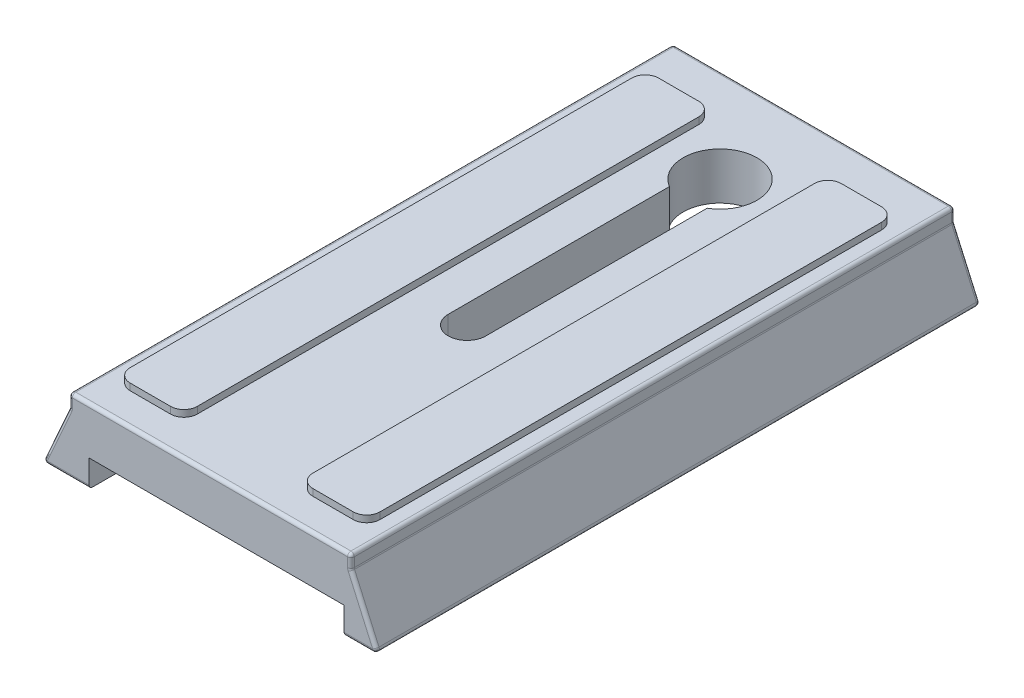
from build123d import *

# Parameters (mm, degrees)
BOSS_EXTRUDE1_DEPTH = 90
CUT_EXTRUDE1_DEPTH  = 4
CUT_EXTRUDE2_DEPTH  = 26
FILLET2_R           = 2
CUT_EXTRUDE3_DEPTH  = 0.8
FILLET3_R           = 0.5
FILLET4_R           = 0.5
BOSS_EXTRUDE2_DEPTH = 1
FILLET5_R           = 0.5


with BuildPart() as part:
    # Sketch2 → Boss-Extrude1 (new body)
    with BuildSketch(Plane.XY):
        Polygon((0, 0), (50, 0), (46, 9), (46, 11), (4, 11), (4, 9), align=None)
    extrude(amount=-BOSS_EXTRUDE1_DEPTH)

    # Sketch3 → Cut-Extrude1 (cut)
    with BuildSketch(Plane.XZ):
        with BuildLine():
            Line((9.5, -41), (14.4, -41))
            ThreePointArc((14.4, -41), (14.824264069, -41.175735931), (15, -41.6))
            Line((15, -41.6), (15, -45.4))
            ThreePointArc((15, -45.4), (14.824264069, -45.824264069), (14.4, -46))
            Line((14.4, -46), (6.5, -46))
            ThreePointArc((6.5, -46), (4.732233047, -46.732233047), (4, -48.5))
            Line((4, -48.5), (4, -87.4))
            Line((4, -87.4), (40, -87.4))
            Line((40, -87.4), (40, -90))
            Line((40, -90), (46, -90))
            Line((46, -90), (46, -43))
            Line((46, -43), (40.2, -43))
            Line((40.2, -43), (45, 0))
            Line((45, 0), (7, 0))
            Line((7, 0), (7, -38.5))
            ThreePointArc((7, -38.5), (7.732233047, -40.267766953), (9.5, -41))
        make_face()
    extrude(amount=-CUT_EXTRUDE1_DEPTH, mode=Mode.SUBTRACT)

    # Sketch4 → Cut-Extrude2 (cut)
    with BuildSketch(Plane.XZ.offset(-4)):
        with BuildLine():
            Line((22.2, -38.3), (22.2, -71.266079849))
            ThreePointArc((22.2, -71.266079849), (25, -81.5), (27.8, -71.266079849))
            Line((27.8, -71.266079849), (27.8, -38.3))
            ThreePointArc((27.8, -38.3), (25, -35.5), (22.2, -38.3))
        make_face()
    extrude(amount=-CUT_EXTRUDE2_DEPTH, mode=Mode.SUBTRACT)

    # Fillet2
    fillet2_edges = [part.edges().sort_by_distance(p)[0] for p in [
        (46, 2, -43),
    ]]
    fillet(fillet2_edges, radius=FILLET2_R)

    # Sketch5 → Cut-Extrude3 (cut)
    with BuildSketch(Plane.XZ.offset(-4)):
        with BuildLine():
            Line((17.35, -38.3), (17.35, -69.266079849))
            ThreePointArc((17.35, -69.266079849), (17.935786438, -70.680293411), (19.35, -71.266079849))
            Line((19.35, -71.266079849), (30.65, -71.266079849))
            ThreePointArc((30.65, -71.266079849), (32.064213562, -70.680293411), (32.65, -69.266079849))
            Line((32.65, -69.266079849), (32.65, -38.3))
            ThreePointArc((32.65, -38.3), (25, -30.65), (17.35, -38.3))
        make_face()
    extrude(amount=-CUT_EXTRUDE3_DEPTH, mode=Mode.SUBTRACT)

    # Fillet3
    fillet3_edges = [part.edges().sort_by_distance(p)[0] for p in [
        (40.2, 2, -43),
    ]]
    fillet(fillet3_edges, radius=FILLET3_R)

    # Fillet4
    fillet4_edges = [part.edges().sort_by_distance(p)[0] for p in [
        (50, 0, -45),
        (0, 0, -45),
    ]]
    fillet(fillet4_edges, radius=FILLET4_R)

    # Sketch6 → Boss-Extrude2 (add)
    with BuildSketch(Plane(origin=(0, 11, 0), x_dir=(1, 0, 0), z_dir=(0, 1, 0))):
        with BuildLine():
            Line((33.612746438, 81.450733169), (33.612746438, 6.72723988))
            ThreePointArc((33.612746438, 6.72723988), (34.198532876, 5.313026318), (35.612746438, 4.72723988))
            Line((35.612746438, 4.72723988), (41.612746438, 4.72723988))
            ThreePointArc((41.612746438, 4.72723988), (43.02696, 5.313026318), (43.612746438, 6.72723988))
            Line((43.612746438, 6.72723988), (43.612746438, 81.450733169))
            ThreePointArc((43.612746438, 81.450733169), (43.02696, 82.864946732), (41.612746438, 83.450733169))
            Line((41.612746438, 83.450733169), (35.612746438, 83.450733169))
            ThreePointArc((35.612746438, 83.450733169), (34.198532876, 82.864946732), (33.612746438, 81.450733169))
        make_face()
        with BuildLine():
            Line((14.387253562, 4.72723988), (8.387253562, 4.72723988))
            ThreePointArc((8.387253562, 4.72723988), (6.97304, 5.313026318), (6.387253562, 6.72723988))
            Line((6.387253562, 6.72723988), (6.387253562, 81.450733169))
            ThreePointArc((6.387253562, 81.450733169), (6.97304, 82.864946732), (8.387253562, 83.450733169))
            Line((8.387253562, 83.450733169), (14.387253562, 83.450733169))
            ThreePointArc((14.387253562, 83.450733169), (15.801467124, 82.864946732), (16.387253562, 81.450733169))
            Line((16.387253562, 81.450733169), (16.387253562, 6.72723988))
            ThreePointArc((16.387253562, 6.72723988), (15.801467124, 5.313026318), (14.387253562, 4.72723988))
        make_face()
    extrude(amount=BOSS_EXTRUDE2_DEPTH)

    # Fillet5
    fillet5_edges = [part.edges().sort_by_distance(p)[0] for p in [
        (0.35013487, 0.22754323, 0),
        (49.64986513, 0.22754323, 0),
        (0.35013487, 0.22754323, -90),
        (49.64986513, 0.22754323, -90),
        (2.156237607, 4.851534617, 0),
        (47.115309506, 0, 0),
        (3.884690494, 0, 0),
        (47.843762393, 4.851534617, 0),
        (46, 10, 0),
        (25, 11, 0),
        (4, 10, 0),
        (2.156237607, 4.851534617, -90),
        (47.615309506, 0, -90),
        (20.384690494, 0, -90),
        (47.843762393, 4.851534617, -90),
        (46, 10, -90),
        (4, 10, -90),
        (46, 9, -45),
        (46, 11, -45),
        (4, 11, -45),
        (4, 9, -45),
        (25, 11, -90),
    ]]
    fillet(fillet5_edges, radius=FILLET5_R)


solid = part.part
